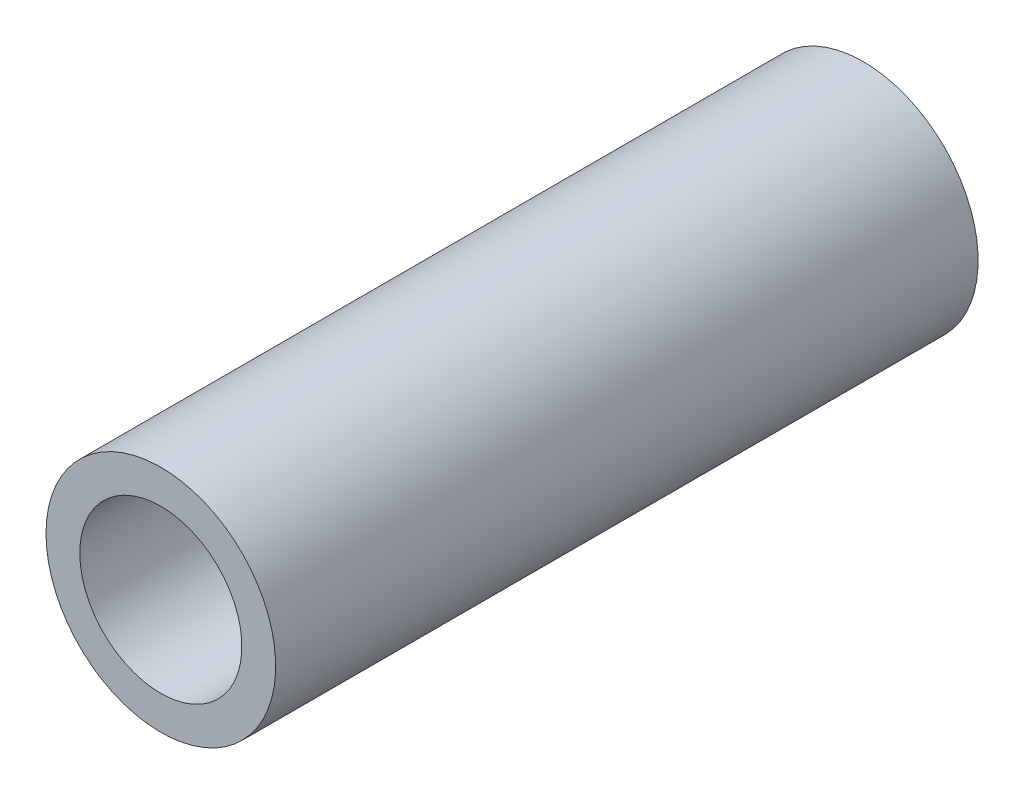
ISO-10303-21;
HEADER;
FILE_DESCRIPTION(('STEP AP214'),'2;1');
FILE_NAME('part.step','',(''),(''),'','','');
FILE_SCHEMA(('AUTOMOTIVE_DESIGN { 1 0 10303 214 1 1 1 1 }'));
ENDSEC;
DATA;
#1=APPLICATION_CONTEXT('core data for automotive mechanical design processes');
#2=APPLICATION_PROTOCOL_DEFINITION('international standard','automotive_design',2000,#1);
#3=PRODUCT_CONTEXT('',#1,'mechanical');
#4=PRODUCT('Part','Part','',(#3));
#5=PRODUCT_RELATED_PRODUCT_CATEGORY('part','',(#4));
#6=PRODUCT_DEFINITION_FORMATION('','',#4);
#7=PRODUCT_DEFINITION_CONTEXT('part definition',#1,'design');
#8=PRODUCT_DEFINITION('design','',#6,#7);
#9=PRODUCT_DEFINITION_SHAPE('','',#8);
#10=(LENGTH_UNIT() NAMED_UNIT(*) SI_UNIT(.MILLI.,.METRE.));
#11=(NAMED_UNIT(*) PLANE_ANGLE_UNIT() SI_UNIT($,.RADIAN.));
#12=(NAMED_UNIT(*) SI_UNIT($,.STERADIAN.) SOLID_ANGLE_UNIT());
#13=UNCERTAINTY_MEASURE_WITH_UNIT(LENGTH_MEASURE(1.E-05),#10,'distance_accuracy_value','');
#14=(GEOMETRIC_REPRESENTATION_CONTEXT(3) GLOBAL_UNCERTAINTY_ASSIGNED_CONTEXT((#13)) GLOBAL_UNIT_ASSIGNED_CONTEXT((#10,
#11,#12)) REPRESENTATION_CONTEXT('',''));
#15=CARTESIAN_POINT('',(0.,0.,0.));
#16=DIRECTION('',(0.,0.,1.));
#17=DIRECTION('',(1.,0.,0.));
#18=AXIS2_PLACEMENT_3D('',#15,#16,#17);
#19=CARTESIAN_POINT('',(0.,0.,52.));
#20=DIRECTION('',(0.,0.,1.));
#21=DIRECTION('',(1.,0.,0.));
#22=AXIS2_PLACEMENT_3D('',#19,#20,#21);
#23=PLANE('',#22);
#24=CARTESIAN_POINT('',(0.,0.,52.));
#25=DIRECTION('',(0.,0.,1.));
#26=DIRECTION('',(1.,0.,0.));
#27=AXIS2_PLACEMENT_3D('',#24,#25,#26);
#28=CIRCLE('',#27,8.5);
#29=CARTESIAN_POINT('',(-8.5,0.,52.));
#30=VERTEX_POINT('',#29);
#31=EDGE_CURVE('E10',#30,#30,#28,.T.);
#32=ORIENTED_EDGE('',*,*,#31,.T.);
#33=EDGE_LOOP('',(#32));
#34=FACE_BOUND('',#33,.T.);
#35=CARTESIAN_POINT('',(0.,0.,52.));
#36=DIRECTION('',(0.,0.,1.));
#37=DIRECTION('',(1.,0.,0.));
#38=AXIS2_PLACEMENT_3D('',#35,#36,#37);
#39=CIRCLE('',#38,6.);
#40=CARTESIAN_POINT('',(-6.,0.,52.));
#41=VERTEX_POINT('',#40);
#42=EDGE_CURVE('E43',#41,#41,#39,.T.);
#43=ORIENTED_EDGE('',*,*,#42,.F.);
#44=EDGE_LOOP('',(#43));
#45=FACE_BOUND('',#44,.T.);
#46=ADVANCED_FACE('F32',(#34,#45),#23,.T.);
#47=CARTESIAN_POINT('',(0.,0.,0.));
#48=DIRECTION('',(0.,0.,1.));
#49=DIRECTION('',(1.,0.,0.));
#50=AXIS2_PLACEMENT_3D('',#47,#48,#49);
#51=PLANE('',#50);
#52=CARTESIAN_POINT('',(0.,0.,0.));
#53=DIRECTION('',(0.,0.,1.));
#54=DIRECTION('',(1.,0.,0.));
#55=AXIS2_PLACEMENT_3D('',#52,#53,#54);
#56=CIRCLE('',#55,8.5);
#57=CARTESIAN_POINT('',(-8.5,0.,0.));
#58=VERTEX_POINT('',#57);
#59=EDGE_CURVE('E36',#58,#58,#56,.T.);
#60=ORIENTED_EDGE('',*,*,#59,.F.);
#61=EDGE_LOOP('',(#60));
#62=FACE_BOUND('',#61,.T.);
#63=CARTESIAN_POINT('',(0.,0.,0.));
#64=DIRECTION('',(0.,0.,1.));
#65=DIRECTION('',(1.,0.,0.));
#66=AXIS2_PLACEMENT_3D('',#63,#64,#65);
#67=CIRCLE('',#66,6.);
#68=CARTESIAN_POINT('',(-6.,0.,0.));
#69=VERTEX_POINT('',#68);
#70=EDGE_CURVE('E45',#69,#69,#67,.T.);
#71=ORIENTED_EDGE('',*,*,#70,.T.);
#72=EDGE_LOOP('',(#71));
#73=FACE_BOUND('',#72,.T.);
#74=ADVANCED_FACE('F55',(#62,#73),#51,.F.);
#75=CARTESIAN_POINT('',(0.,0.,52.));
#76=DIRECTION('',(0.,0.,-1.));
#77=DIRECTION('',(-1.,0.,0.));
#78=AXIS2_PLACEMENT_3D('',#75,#76,#77);
#79=CYLINDRICAL_SURFACE('',#78,8.5);
#80=CARTESIAN_POINT('',(-8.5,0.,52.));
#81=CARTESIAN_POINT('',(-8.5,0.,51.4583333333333));
#82=CARTESIAN_POINT('',(-8.5,0.,50.9166666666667));
#83=CARTESIAN_POINT('',(-8.5,0.,49.8333333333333));
#84=CARTESIAN_POINT('',(-8.5,0.,49.2916666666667));
#85=CARTESIAN_POINT('',(-8.5,0.,48.2083333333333));
#86=CARTESIAN_POINT('',(-8.5,0.,47.6666666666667));
#87=CARTESIAN_POINT('',(-8.5,0.,46.5833333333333));
#88=CARTESIAN_POINT('',(-8.5,0.,46.0416666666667));
#89=CARTESIAN_POINT('',(-8.5,0.,44.9583333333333));
#90=CARTESIAN_POINT('',(-8.5,0.,44.4166666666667));
#91=CARTESIAN_POINT('',(-8.5,0.,43.3333333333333));
#92=CARTESIAN_POINT('',(-8.5,0.,42.7916666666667));
#93=CARTESIAN_POINT('',(-8.5,0.,41.7083333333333));
#94=CARTESIAN_POINT('',(-8.5,0.,41.1666666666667));
#95=CARTESIAN_POINT('',(-8.5,0.,40.0833333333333));
#96=CARTESIAN_POINT('',(-8.5,0.,39.5416666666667));
#97=CARTESIAN_POINT('',(-8.5,0.,38.4583333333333));
#98=CARTESIAN_POINT('',(-8.5,0.,37.9166666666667));
#99=CARTESIAN_POINT('',(-8.5,0.,36.8333333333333));
#100=CARTESIAN_POINT('',(-8.5,0.,36.2916666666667));
#101=CARTESIAN_POINT('',(-8.5,0.,35.2083333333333));
#102=CARTESIAN_POINT('',(-8.5,0.,34.6666666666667));
#103=CARTESIAN_POINT('',(-8.5,0.,33.5833333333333));
#104=CARTESIAN_POINT('',(-8.5,0.,33.0416666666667));
#105=CARTESIAN_POINT('',(-8.5,0.,31.9583333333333));
#106=CARTESIAN_POINT('',(-8.5,0.,31.4166666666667));
#107=CARTESIAN_POINT('',(-8.5,0.,30.3333333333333));
#108=CARTESIAN_POINT('',(-8.5,0.,29.7916666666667));
#109=CARTESIAN_POINT('',(-8.5,0.,28.7083333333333));
#110=CARTESIAN_POINT('',(-8.5,0.,28.1666666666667));
#111=CARTESIAN_POINT('',(-8.5,0.,27.0833333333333));
#112=CARTESIAN_POINT('',(-8.5,0.,26.5416666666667));
#113=CARTESIAN_POINT('',(-8.5,0.,25.4583333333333));
#114=CARTESIAN_POINT('',(-8.5,0.,24.9166666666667));
#115=CARTESIAN_POINT('',(-8.5,0.,23.8333333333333));
#116=CARTESIAN_POINT('',(-8.5,0.,23.2916666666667));
#117=CARTESIAN_POINT('',(-8.5,0.,22.2083333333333));
#118=CARTESIAN_POINT('',(-8.5,0.,21.6666666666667));
#119=CARTESIAN_POINT('',(-8.5,0.,20.5833333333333));
#120=CARTESIAN_POINT('',(-8.5,0.,20.0416666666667));
#121=CARTESIAN_POINT('',(-8.5,0.,18.9583333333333));
#122=CARTESIAN_POINT('',(-8.5,0.,18.4166666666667));
#123=CARTESIAN_POINT('',(-8.5,0.,17.3333333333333));
#124=CARTESIAN_POINT('',(-8.5,0.,16.7916666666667));
#125=CARTESIAN_POINT('',(-8.5,0.,15.7083333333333));
#126=CARTESIAN_POINT('',(-8.5,0.,15.1666666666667));
#127=CARTESIAN_POINT('',(-8.5,0.,14.0833333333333));
#128=CARTESIAN_POINT('',(-8.5,0.,13.5416666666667));
#129=CARTESIAN_POINT('',(-8.5,0.,12.4583333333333));
#130=CARTESIAN_POINT('',(-8.5,0.,11.9166666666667));
#131=CARTESIAN_POINT('',(-8.5,0.,10.8333333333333));
#132=CARTESIAN_POINT('',(-8.5,0.,10.2916666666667));
#133=CARTESIAN_POINT('',(-8.5,0.,9.20833333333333));
#134=CARTESIAN_POINT('',(-8.5,0.,8.66666666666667));
#135=CARTESIAN_POINT('',(-8.5,0.,7.58333333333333));
#136=CARTESIAN_POINT('',(-8.5,0.,7.04166666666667));
#137=CARTESIAN_POINT('',(-8.5,0.,5.95833333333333));
#138=CARTESIAN_POINT('',(-8.5,0.,5.41666666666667));
#139=CARTESIAN_POINT('',(-8.5,0.,4.33333333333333));
#140=CARTESIAN_POINT('',(-8.5,0.,3.79166666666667));
#141=CARTESIAN_POINT('',(-8.5,0.,2.70833333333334));
#142=CARTESIAN_POINT('',(-8.5,0.,2.16666666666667));
#143=CARTESIAN_POINT('',(-8.5,0.,1.08333333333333));
#144=CARTESIAN_POINT('',(-8.5,0.,0.541666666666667));
#145=CARTESIAN_POINT('',(-8.5,0.,0.));
#146=B_SPLINE_CURVE_WITH_KNOTS('',3,(#80,#81,#82,#83,#84,#85,#86,#87,#88,#89,#90,#91,#92,#93,
#94,#95,#96,#97,#98,#99,#100,#101,#102,#103,#104,#105,#106,#107,#108,#109,#110,#111,#112,#113,
#114,#115,#116,#117,#118,#119,#120,#121,#122,#123,#124,#125,#126,#127,#128,#129,#130,#131,#132,
#133,#134,#135,#136,#137,#138,#139,#140,#141,#142,#143,#144,#145),.UNSPECIFIED.,.F.,.F.,(4,2,2,
2,2,2,2,2,2,2,2,2,2,2,2,2,2,2,2,2,2,2,2,2,2,2,2,2,2,2,2,2,4),(0.,1.62499999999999,3.25,4.875,
6.49999999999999,8.12499999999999,9.74999999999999,11.375,13.,14.625,16.25,17.875,19.5,21.125,
22.75,24.375,26.,27.625,29.25,30.875,32.5,34.125,35.75,37.375,39.,40.625,42.25,43.875,45.5,
47.125,48.75,50.375,52.),.UNSPECIFIED.);
#147=EDGE_CURVE('BSEAM34',#30,#58,#146,.T.);
#148=ORIENTED_EDGE('',*,*,#31,.F.);
#149=ORIENTED_EDGE('',*,*,#59,.T.);
#150=ORIENTED_EDGE('',*,*,#147,.T.);
#151=ORIENTED_EDGE('',*,*,#147,.F.);
#152=EDGE_LOOP('',(#148,#150,#149,#151));
#153=FACE_BOUND('',#152,.T.);
#154=ADVANCED_FACE('F34',(#153),#79,.T.);
#155=CARTESIAN_POINT('',(0.,0.,52.));
#156=DIRECTION('',(0.,0.,-1.));
#157=DIRECTION('',(-1.,0.,0.));
#158=AXIS2_PLACEMENT_3D('',#155,#156,#157);
#159=CYLINDRICAL_SURFACE('',#158,6.);
#160=CARTESIAN_POINT('',(-6.,0.,52.));
#161=CARTESIAN_POINT('',(-6.,0.,51.4583333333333));
#162=CARTESIAN_POINT('',(-6.,0.,50.9166666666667));
#163=CARTESIAN_POINT('',(-6.,0.,49.8333333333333));
#164=CARTESIAN_POINT('',(-6.,0.,49.2916666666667));
#165=CARTESIAN_POINT('',(-6.,0.,48.2083333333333));
#166=CARTESIAN_POINT('',(-6.,0.,47.6666666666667));
#167=CARTESIAN_POINT('',(-6.,0.,46.5833333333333));
#168=CARTESIAN_POINT('',(-6.,0.,46.0416666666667));
#169=CARTESIAN_POINT('',(-6.,0.,44.9583333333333));
#170=CARTESIAN_POINT('',(-6.,0.,44.4166666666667));
#171=CARTESIAN_POINT('',(-6.,0.,43.3333333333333));
#172=CARTESIAN_POINT('',(-6.,0.,42.7916666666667));
#173=CARTESIAN_POINT('',(-6.,0.,41.7083333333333));
#174=CARTESIAN_POINT('',(-6.,0.,41.1666666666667));
#175=CARTESIAN_POINT('',(-6.,0.,40.0833333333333));
#176=CARTESIAN_POINT('',(-6.,0.,39.5416666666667));
#177=CARTESIAN_POINT('',(-6.,0.,38.4583333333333));
#178=CARTESIAN_POINT('',(-6.,0.,37.9166666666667));
#179=CARTESIAN_POINT('',(-6.,0.,36.8333333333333));
#180=CARTESIAN_POINT('',(-6.,0.,36.2916666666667));
#181=CARTESIAN_POINT('',(-6.,0.,35.2083333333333));
#182=CARTESIAN_POINT('',(-6.,0.,34.6666666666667));
#183=CARTESIAN_POINT('',(-6.,0.,33.5833333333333));
#184=CARTESIAN_POINT('',(-6.,0.,33.0416666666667));
#185=CARTESIAN_POINT('',(-6.,0.,31.9583333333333));
#186=CARTESIAN_POINT('',(-6.,0.,31.4166666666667));
#187=CARTESIAN_POINT('',(-6.,0.,30.3333333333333));
#188=CARTESIAN_POINT('',(-6.,0.,29.7916666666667));
#189=CARTESIAN_POINT('',(-6.,0.,28.7083333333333));
#190=CARTESIAN_POINT('',(-6.,0.,28.1666666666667));
#191=CARTESIAN_POINT('',(-6.,0.,27.0833333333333));
#192=CARTESIAN_POINT('',(-6.,0.,26.5416666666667));
#193=CARTESIAN_POINT('',(-6.,0.,25.4583333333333));
#194=CARTESIAN_POINT('',(-6.,0.,24.9166666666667));
#195=CARTESIAN_POINT('',(-6.,0.,23.8333333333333));
#196=CARTESIAN_POINT('',(-6.,0.,23.2916666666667));
#197=CARTESIAN_POINT('',(-6.,0.,22.2083333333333));
#198=CARTESIAN_POINT('',(-6.,0.,21.6666666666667));
#199=CARTESIAN_POINT('',(-6.,0.,20.5833333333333));
#200=CARTESIAN_POINT('',(-6.,0.,20.0416666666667));
#201=CARTESIAN_POINT('',(-6.,0.,18.9583333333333));
#202=CARTESIAN_POINT('',(-6.,0.,18.4166666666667));
#203=CARTESIAN_POINT('',(-6.,0.,17.3333333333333));
#204=CARTESIAN_POINT('',(-6.,0.,16.7916666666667));
#205=CARTESIAN_POINT('',(-6.,0.,15.7083333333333));
#206=CARTESIAN_POINT('',(-6.,0.,15.1666666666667));
#207=CARTESIAN_POINT('',(-6.,0.,14.0833333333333));
#208=CARTESIAN_POINT('',(-6.,0.,13.5416666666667));
#209=CARTESIAN_POINT('',(-6.,0.,12.4583333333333));
#210=CARTESIAN_POINT('',(-6.,0.,11.9166666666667));
#211=CARTESIAN_POINT('',(-6.,0.,10.8333333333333));
#212=CARTESIAN_POINT('',(-6.,0.,10.2916666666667));
#213=CARTESIAN_POINT('',(-6.,0.,9.20833333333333));
#214=CARTESIAN_POINT('',(-6.,0.,8.66666666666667));
#215=CARTESIAN_POINT('',(-6.,0.,7.58333333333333));
#216=CARTESIAN_POINT('',(-6.,0.,7.04166666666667));
#217=CARTESIAN_POINT('',(-6.,0.,5.95833333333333));
#218=CARTESIAN_POINT('',(-6.,0.,5.41666666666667));
#219=CARTESIAN_POINT('',(-6.,0.,4.33333333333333));
#220=CARTESIAN_POINT('',(-6.,0.,3.79166666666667));
#221=CARTESIAN_POINT('',(-6.,0.,2.70833333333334));
#222=CARTESIAN_POINT('',(-6.,0.,2.16666666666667));
#223=CARTESIAN_POINT('',(-6.,0.,1.08333333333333));
#224=CARTESIAN_POINT('',(-6.,0.,0.541666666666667));
#225=CARTESIAN_POINT('',(-6.,0.,0.));
#226=B_SPLINE_CURVE_WITH_KNOTS('',3,(#160,#161,#162,#163,#164,#165,#166,#167,#168,#169,#170,
#171,#172,#173,#174,#175,#176,#177,#178,#179,#180,#181,#182,#183,#184,#185,#186,#187,#188,#189,
#190,#191,#192,#193,#194,#195,#196,#197,#198,#199,#200,#201,#202,#203,#204,#205,#206,#207,#208,
#209,#210,#211,#212,#213,#214,#215,#216,#217,#218,#219,#220,#221,#222,#223,#224,#225),
.UNSPECIFIED.,.F.,.F.,(4,2,2,2,2,2,2,2,2,2,2,2,2,2,2,2,2,2,2,2,2,2,2,2,2,2,2,2,2,2,2,2,4),(0.,
1.625,3.25,4.875,6.50000000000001,8.125,9.75,11.375,13.,14.625,16.25,17.875,19.5,21.125,22.75,
24.375,26.,27.625,29.25,30.875,32.5,34.125,35.75,37.375,39.,40.625,42.25,43.875,45.5,47.125,
48.75,50.375,52.),.UNSPECIFIED.);
#227=EDGE_CURVE('BSEAM51',#41,#69,#226,.T.);
#228=ORIENTED_EDGE('',*,*,#42,.T.);
#229=ORIENTED_EDGE('',*,*,#70,.F.);
#230=ORIENTED_EDGE('',*,*,#227,.T.);
#231=ORIENTED_EDGE('',*,*,#227,.F.);
#232=EDGE_LOOP('',(#228,#230,#229,#231));
#233=FACE_BOUND('',#232,.T.);
#234=ADVANCED_FACE('F51',(#233),#159,.F.);
#235=CLOSED_SHELL('',(#46,#74,#154,#234));
#236=MANIFOLD_SOLID_BREP('B2',#235);
#237=ADVANCED_BREP_SHAPE_REPRESENTATION('',(#18,#236),#14);
#238=SHAPE_DEFINITION_REPRESENTATION(#9,#237);
ENDSEC;
END-ISO-10303-21;
